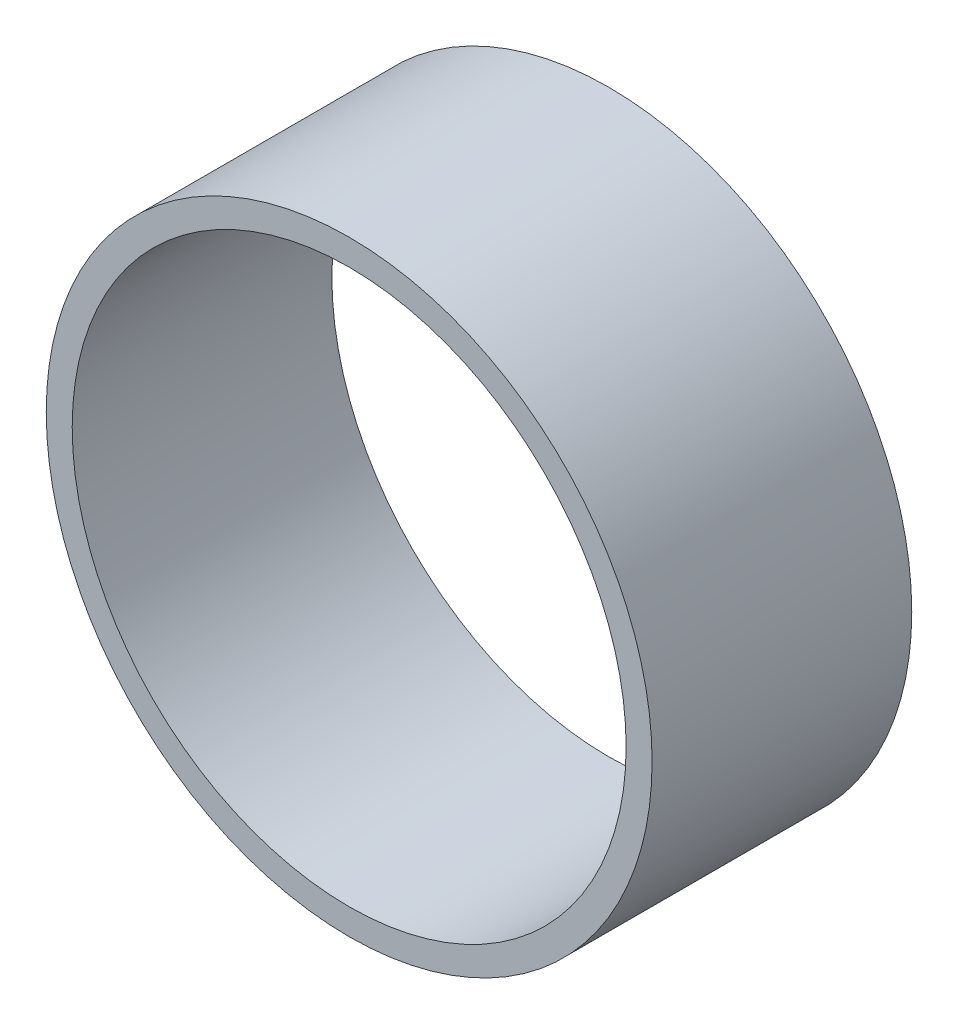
ISO-10303-21;
HEADER;
FILE_DESCRIPTION(('STEP AP214'),'2;1');
FILE_NAME('part.step','',(''),(''),'','','');
FILE_SCHEMA(('AUTOMOTIVE_DESIGN { 1 0 10303 214 1 1 1 1 }'));
ENDSEC;
DATA;
#1=APPLICATION_CONTEXT('core data for automotive mechanical design processes');
#2=APPLICATION_PROTOCOL_DEFINITION('international standard','automotive_design',2000,#1);
#3=PRODUCT_CONTEXT('',#1,'mechanical');
#4=PRODUCT('Part','Part','',(#3));
#5=PRODUCT_RELATED_PRODUCT_CATEGORY('part','',(#4));
#6=PRODUCT_DEFINITION_FORMATION('','',#4);
#7=PRODUCT_DEFINITION_CONTEXT('part definition',#1,'design');
#8=PRODUCT_DEFINITION('design','',#6,#7);
#9=PRODUCT_DEFINITION_SHAPE('','',#8);
#10=(LENGTH_UNIT() NAMED_UNIT(*) SI_UNIT(.MILLI.,.METRE.));
#11=(NAMED_UNIT(*) PLANE_ANGLE_UNIT() SI_UNIT($,.RADIAN.));
#12=(NAMED_UNIT(*) SI_UNIT($,.STERADIAN.) SOLID_ANGLE_UNIT());
#13=UNCERTAINTY_MEASURE_WITH_UNIT(LENGTH_MEASURE(1.E-05),#10,'distance_accuracy_value','');
#14=(GEOMETRIC_REPRESENTATION_CONTEXT(3) GLOBAL_UNCERTAINTY_ASSIGNED_CONTEXT((#13)) GLOBAL_UNIT_ASSIGNED_CONTEXT((#10,
#11,#12)) REPRESENTATION_CONTEXT('',''));
#15=CARTESIAN_POINT('',(0.,0.,0.));
#16=DIRECTION('',(0.,0.,1.));
#17=DIRECTION('',(1.,0.,0.));
#18=AXIS2_PLACEMENT_3D('',#15,#16,#17);
#19=CARTESIAN_POINT('',(0.,0.,30.));
#20=DIRECTION('',(0.,0.,1.));
#21=DIRECTION('',(1.,0.,0.));
#22=AXIS2_PLACEMENT_3D('',#19,#20,#21);
#23=PLANE('',#22);
#24=CARTESIAN_POINT('',(0.,0.,30.));
#25=DIRECTION('',(0.,0.,1.));
#26=DIRECTION('',(1.,0.,0.));
#27=AXIS2_PLACEMENT_3D('',#24,#25,#26);
#28=CIRCLE('',#27,35.);
#29=CARTESIAN_POINT('',(35.,0.,30.));
#30=VERTEX_POINT('',#29);
#31=EDGE_CURVE('E10',#30,#30,#28,.T.);
#32=ORIENTED_EDGE('',*,*,#31,.T.);
#33=EDGE_LOOP('',(#32));
#34=FACE_BOUND('',#33,.T.);
#35=CARTESIAN_POINT('',(0.,0.,30.));
#36=DIRECTION('',(0.,0.,1.));
#37=DIRECTION('',(1.,0.,0.));
#38=AXIS2_PLACEMENT_3D('',#35,#36,#37);
#39=CIRCLE('',#38,32.);
#40=CARTESIAN_POINT('',(32.,0.,30.));
#41=VERTEX_POINT('',#40);
#42=EDGE_CURVE('E38',#41,#41,#39,.T.);
#43=ORIENTED_EDGE('',*,*,#42,.F.);
#44=EDGE_LOOP('',(#43));
#45=FACE_BOUND('',#44,.T.);
#46=ADVANCED_FACE('F27',(#34,#45),#23,.T.);
#47=CARTESIAN_POINT('',(0.,0.,0.));
#48=DIRECTION('',(0.,0.,1.));
#49=DIRECTION('',(1.,0.,0.));
#50=AXIS2_PLACEMENT_3D('',#47,#48,#49);
#51=PLANE('',#50);
#52=CARTESIAN_POINT('',(0.,0.,0.));
#53=DIRECTION('',(0.,0.,1.));
#54=DIRECTION('',(1.,0.,0.));
#55=AXIS2_PLACEMENT_3D('',#52,#53,#54);
#56=CIRCLE('',#55,35.);
#57=CARTESIAN_POINT('',(35.,0.,0.));
#58=VERTEX_POINT('',#57);
#59=EDGE_CURVE('E34',#58,#58,#56,.T.);
#60=ORIENTED_EDGE('',*,*,#59,.F.);
#61=EDGE_LOOP('',(#60));
#62=FACE_BOUND('',#61,.T.);
#63=CARTESIAN_POINT('',(0.,0.,0.));
#64=DIRECTION('',(0.,0.,1.));
#65=DIRECTION('',(1.,0.,0.));
#66=AXIS2_PLACEMENT_3D('',#63,#64,#65);
#67=CIRCLE('',#66,32.);
#68=CARTESIAN_POINT('',(32.,0.,0.));
#69=VERTEX_POINT('',#68);
#70=EDGE_CURVE('E42',#69,#69,#67,.T.);
#71=ORIENTED_EDGE('',*,*,#70,.T.);
#72=EDGE_LOOP('',(#71));
#73=FACE_BOUND('',#72,.T.);
#74=ADVANCED_FACE('F48',(#62,#73),#51,.F.);
#75=CARTESIAN_POINT('',(0.,0.,30.));
#76=DIRECTION('',(0.,0.,-1.));
#77=DIRECTION('',(-1.,0.,0.));
#78=AXIS2_PLACEMENT_3D('',#75,#76,#77);
#79=CYLINDRICAL_SURFACE('',#78,35.);
#80=ORIENTED_EDGE('',*,*,#31,.F.);
#81=EDGE_LOOP('',(#80));
#82=FACE_BOUND('',#81,.T.);
#83=ORIENTED_EDGE('',*,*,#59,.T.);
#84=EDGE_LOOP('',(#83));
#85=FACE_BOUND('',#84,.T.);
#86=ADVANCED_FACE('F29',(#82,#85),#79,.T.);
#87=CARTESIAN_POINT('',(0.,0.,30.));
#88=DIRECTION('',(0.,0.,-1.));
#89=DIRECTION('',(-1.,0.,0.));
#90=AXIS2_PLACEMENT_3D('',#87,#88,#89);
#91=CYLINDRICAL_SURFACE('',#90,32.);
#92=ORIENTED_EDGE('',*,*,#42,.T.);
#93=EDGE_LOOP('',(#92));
#94=FACE_BOUND('',#93,.T.);
#95=ORIENTED_EDGE('',*,*,#70,.F.);
#96=EDGE_LOOP('',(#95));
#97=FACE_BOUND('',#96,.T.);
#98=ADVANCED_FACE('F50',(#94,#97),#91,.F.);
#99=CLOSED_SHELL('',(#46,#74,#86,#98));
#100=MANIFOLD_SOLID_BREP('B2',#99);
#101=ADVANCED_BREP_SHAPE_REPRESENTATION('',(#18,#100),#14);
#102=SHAPE_DEFINITION_REPRESENTATION(#9,#101);
ENDSEC;
END-ISO-10303-21;
